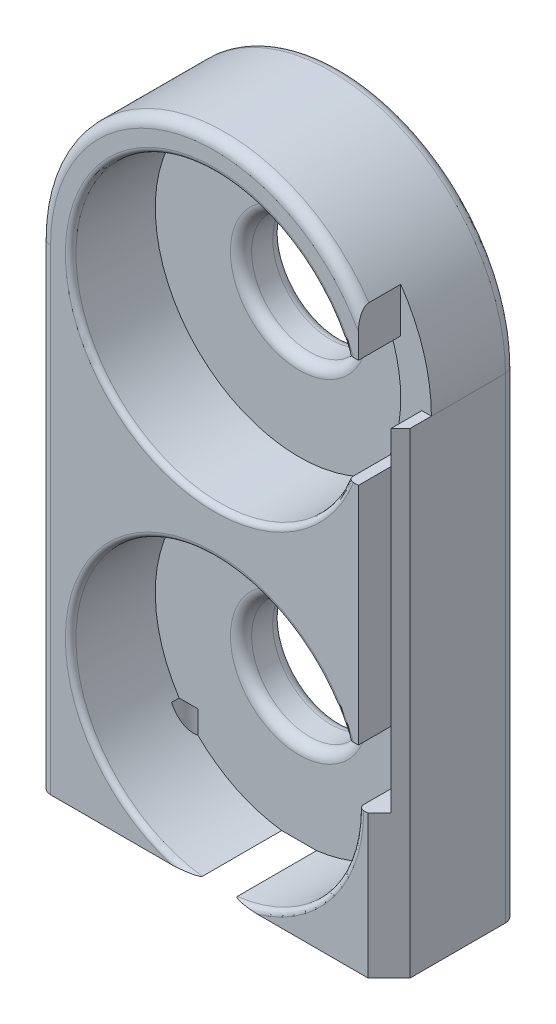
from build123d import *

# Parameters (mm, degrees)
ESBO_O1_R                = 5.5
RESSALTO_EXTRUS_O1_DEPTH = 12
ESBO_O2_R                = 13.6
CORTE_EXTRUS_O1_DEPTH    = 8
CORTE_EXTRUS_O2_DEPTH    = 4
FILETE7_R                = 1
FILETE9_R                = 0.5
ESBO_O6_R                = 1.75
CORTE_EXTRUS_O3_DEPTH    = 6
CHANFRO1_SIZE            = 2


with BuildPart() as part:
    # Esbo_o1 → Ressalto-extrus_o1 (new body)
    with BuildSketch(Plane.XY):
        with BuildLine():
            Line((-16.5, 0), (-16.5, 45))
            ThreePointArc((-16.5, 45), (0, 61.5), (16.5, 45))
            Line((16.5, 45), (16.5, 0))
            Line((16.5, 0), (-16.5, 0))
        make_face()
        with Locations((0, 45)):
            Circle(ESBO_O1_R, mode=Mode.SUBTRACT)
        with Locations((0, 13.5)):
            Circle(ESBO_O1_R, mode=Mode.SUBTRACT)
    extrude(amount=RESSALTO_EXTRUS_O1_DEPTH)

    # Esbo_o2 → Corte-extrus_o1 (cut)
    with BuildSketch(Plane.XY.offset(12)):
        with Locations((0, 45)):
            Circle(ESBO_O2_R)
        with Locations((0, 13.5)):
            Circle(ESBO_O2_R)
    extrude(amount=-CORTE_EXTRUS_O1_DEPTH, mode=Mode.SUBTRACT)

    # Esbo_o5 → Corte-extrus_o2 (cut)
    with BuildSketch(Plane.XY.offset(12)):
        Polygon((15.6, 13.5), (15.6, 45), (16.5, 45), (17.6, 45), (17.6, 50.37494186), (15.6, 50.37494186), (15.6, 54.342911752), (13.6, 54.342911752), (13.6, 50.118593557), (12.6, 50.118593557), (12.6, 39.881406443), (13.6, 39.881406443), (13.6, 18.618593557), (12.6, 18.618593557), (12.6, 13.5), (13.6, 13.5), align=None)
    extrude(amount=-CORTE_EXTRUS_O2_DEPTH, mode=Mode.SUBTRACT)

    # Filete7
    filete7_edges = [part.edges().sort_by_distance(p)[0] for p in [
        (-5.5, 45, 0),
        (-5.5, 13.5, 0),
        (-16.5, 22.5, 12),
        (-5.5, 45, 4),
        (-5.5, 13.5, 4),
        (-4.891318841, 60.75833113, 12),
        (-16.5, 22.5, 0),
        (0, 61.5, 0),
        (16.5, 22.5, 0),
    ]]
    fillet(filete7_edges, radius=FILETE7_R)

    # Filete9
    filete9_edges = [part.edges().sort_by_distance(p)[0] for p in [
        (-13.6, 45, 12),
        (10.182053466, 4.484136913, 12),
        (-10.800898, 21.76441785, 12),
    ]]
    fillet(filete9_edges, radius=FILETE9_R)

    # Esbo_o6 → Corte-extrus_o3 (cut)
    with BuildSketch(Plane.XZ):
        with Locations(Location((-14, 9, 0), (0, 0, 270))):
            Circle(ESBO_O6_R)
        with Locations(Location((14, 9, 0), (0, 0, 270))):
            Circle(ESBO_O6_R)
        with Locations(Location((11, 3, 0), (0, 0, 270))):
            Circle(ESBO_O6_R)
        with Locations(Location((-11, 3, 0), (0, 0, 270))):
            Circle(ESBO_O6_R)
    extrude(amount=-CORTE_EXTRUS_O3_DEPTH, mode=Mode.SUBTRACT)

    # Chanfro1
    chanfro1_edges = [part.edges().sort_by_distance(p)[0] for p in [
        (16.5, 22.5, 12),
    ]]
    chamfer(chanfro1_edges, length=CHANFRO1_SIZE)


solid = part.part
